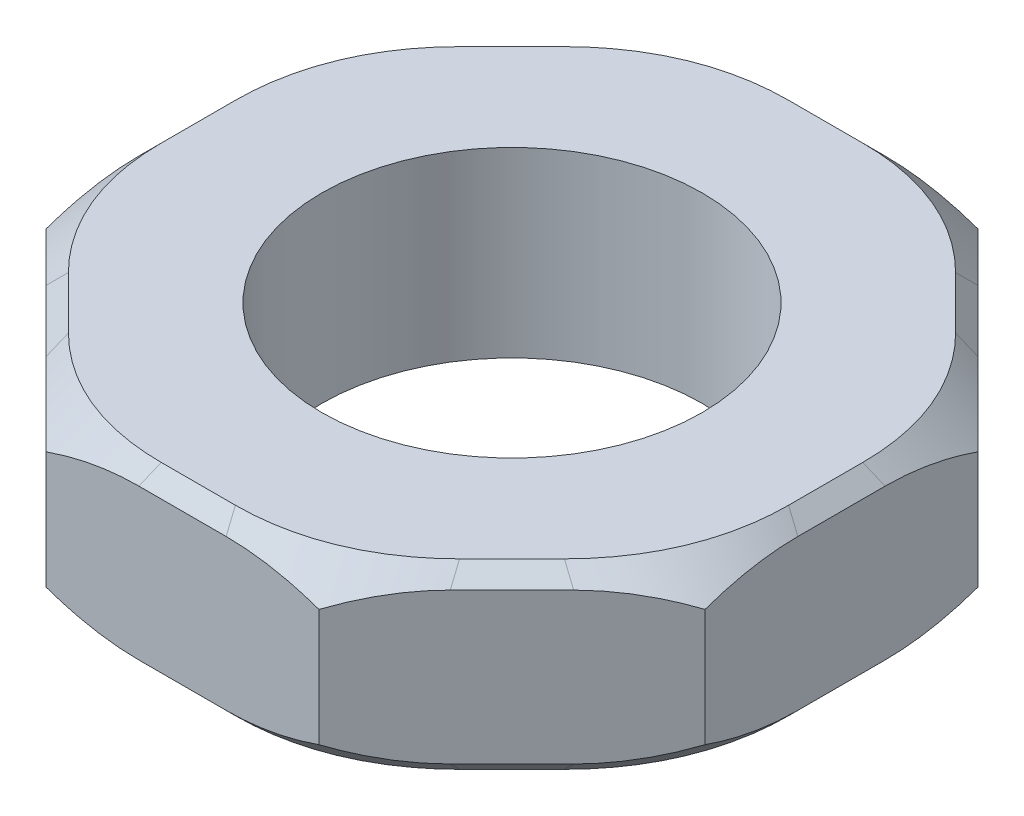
from build123d import *

# Parameters (mm, degrees)
ESQUISSE2_R      = 12
EXTRUSION1_DEPTH = 11.5
CHANFREIN2_SIZE  = 1
CONG_1_R         = 20


with BuildPart() as part:
    # Esquisse2 → Extrusion1 (new body)
    with BuildSketch(Plane(origin=(0, 0, 0), x_dir=(1, 0, 0), z_dir=(0, 1, 0))):
        Polygon((-20.785, 8.609428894), (-20.785, -8.609428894), (-8.609428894, -20.785), (8.609428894, -20.785), (20.785, -8.609428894), (20.785, 8.609428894), (8.609428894, 20.785), (-8.609428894, 20.785), align=None)
        with Locations(Location((0, 0, 0), (0, 0, 270))):
            Circle(ESQUISSE2_R, mode=Mode.SUBTRACT)
    extrude(amount=EXTRUSION1_DEPTH)

    # Chanfrein2
    chanfrein2_edges = [part.edges().sort_by_distance(p)[0] for p in [
        (-14.697214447, 11.5, 14.697214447),
        (-20.785, 0, 0),
        (-14.697214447, 0, -14.697214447),
        (0, 11.5, 20.785),
        (14.697214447, 11.5, 14.697214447),
        (20.785, 11.5, 0),
        (14.697214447, 11.5, -14.697214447),
        (0, 11.5, -20.785),
        (-14.697214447, 11.5, -14.697214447),
        (-20.785, 11.5, 0),
        (0, 0, -20.785),
        (14.697214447, 0, -14.697214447),
        (20.785, 0, 0),
        (14.697214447, 0, 14.697214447),
        (0, 0, 20.785),
        (-14.697214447, 0, 14.697214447),
    ]]
    chamfer(chanfrein2_edges, length=CHANFREIN2_SIZE)

    # Cong_1
    cong_1_edges = [part.edges().sort_by_distance(p)[0] for p in [
        (20.285, 0.5, -8.402322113),
        (20.285, 0.5, 8.402322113),
        (8.402322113, 0.5, -20.285),
        (8.402322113, 0.5, 20.285),
        (-8.402322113, 0.5, -20.285),
        (-8.402322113, 0.5, 20.285),
        (-20.285, 0.5, -8.402322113),
        (-20.285, 0.5, 8.402322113),
        (-8.402322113, 11, -20.285),
        (8.402322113, 11, -20.285),
        (-20.285, 11, -8.402322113),
        (20.285, 11, -8.402322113),
        (-20.285, 11, 8.402322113),
        (20.285, 11, 8.402322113),
        (-8.402322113, 11, 20.285),
        (8.402322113, 11, 20.285),
    ]]
    fillet(cong_1_edges, radius=CONG_1_R)


solid = part.part
